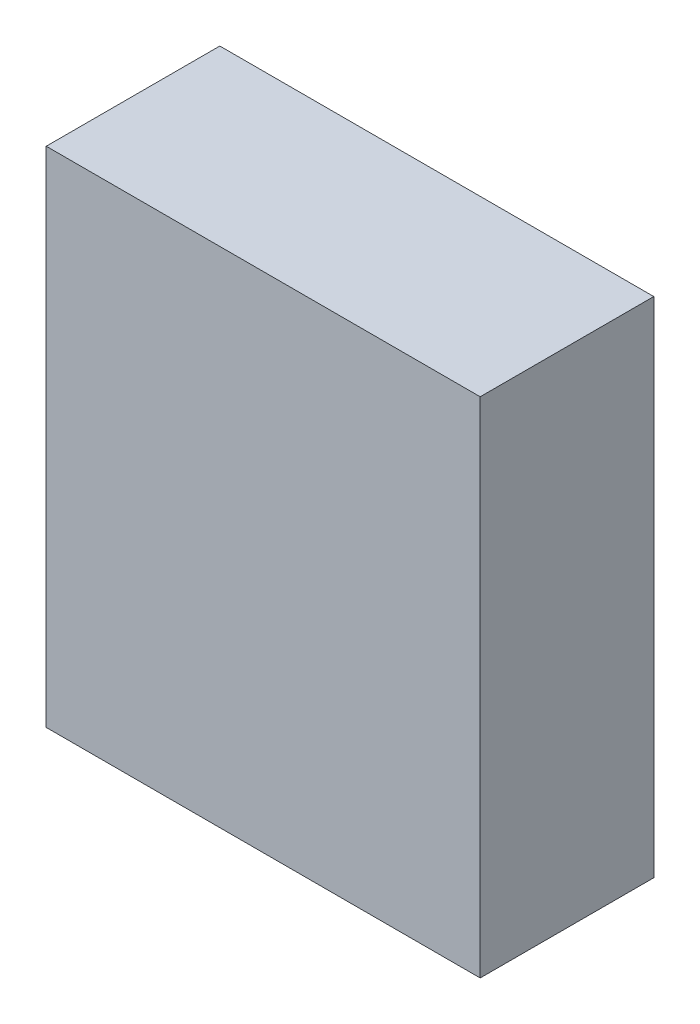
ISO-10303-21;
HEADER;
FILE_DESCRIPTION(('STEP AP214'),'2;1');
FILE_NAME('part.step','',(''),(''),'','','');
FILE_SCHEMA(('AUTOMOTIVE_DESIGN { 1 0 10303 214 1 1 1 1 }'));
ENDSEC;
DATA;
#1=APPLICATION_CONTEXT('core data for automotive mechanical design processes');
#2=APPLICATION_PROTOCOL_DEFINITION('international standard','automotive_design',2000,#1);
#3=PRODUCT_CONTEXT('',#1,'mechanical');
#4=PRODUCT('Part','Part','',(#3));
#5=PRODUCT_RELATED_PRODUCT_CATEGORY('part','',(#4));
#6=PRODUCT_DEFINITION_FORMATION('','',#4);
#7=PRODUCT_DEFINITION_CONTEXT('part definition',#1,'design');
#8=PRODUCT_DEFINITION('design','',#6,#7);
#9=PRODUCT_DEFINITION_SHAPE('','',#8);
#10=(LENGTH_UNIT() NAMED_UNIT(*) SI_UNIT(.MILLI.,.METRE.));
#11=(NAMED_UNIT(*) PLANE_ANGLE_UNIT() SI_UNIT($,.RADIAN.));
#12=(NAMED_UNIT(*) SI_UNIT($,.STERADIAN.) SOLID_ANGLE_UNIT());
#13=UNCERTAINTY_MEASURE_WITH_UNIT(LENGTH_MEASURE(1.E-05),#10,'distance_accuracy_value','');
#14=(GEOMETRIC_REPRESENTATION_CONTEXT(3) GLOBAL_UNCERTAINTY_ASSIGNED_CONTEXT((#13)) GLOBAL_UNIT_ASSIGNED_CONTEXT((#10,
#11,#12)) REPRESENTATION_CONTEXT('',''));
#15=CARTESIAN_POINT('',(0.,0.,0.));
#16=DIRECTION('',(0.,0.,1.));
#17=DIRECTION('',(1.,0.,0.));
#18=AXIS2_PLACEMENT_3D('',#15,#16,#17);
#19=CARTESIAN_POINT('',(0.,1.27000001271E-06,0.499999));
#20=DIRECTION('',(0.,0.,-1.));
#21=DIRECTION('',(0.,-1.,0.));
#22=AXIS2_PLACEMENT_3D('',#19,#20,#21);
#23=PLANE('',#22);
#24=DIRECTION('',(0.,1.,0.));
#25=VECTOR('',#24,1.);
#26=CARTESIAN_POINT('',(-0.62500002,-0.72499982,0.499999));
#27=LINE('',#26,#25);
#28=CARTESIAN_POINT('',(-0.62500002,-0.72499982,0.499999));
#29=VERTEX_POINT('',#28);
#30=CARTESIAN_POINT('',(-0.62500002,0.72500236,0.499999));
#31=VERTEX_POINT('',#30);
#32=EDGE_CURVE('E20',#29,#31,#27,.T.);
#33=ORIENTED_EDGE('',*,*,#32,.F.);
#34=DIRECTION('',(-1.,0.,0.));
#35=VECTOR('',#34,1.);
#36=CARTESIAN_POINT('',(0.62500002,-0.72499982,0.499999));
#37=LINE('',#36,#35);
#38=CARTESIAN_POINT('',(0.62500002,-0.72499982,0.499999));
#39=VERTEX_POINT('',#38);
#40=EDGE_CURVE('E67',#39,#29,#37,.T.);
#41=ORIENTED_EDGE('',*,*,#40,.F.);
#42=DIRECTION('',(0.,-1.,0.));
#43=VECTOR('',#42,1.);
#44=CARTESIAN_POINT('',(0.62500002,0.72500236,0.499999));
#45=LINE('',#44,#43);
#46=CARTESIAN_POINT('',(0.62500002,0.72500236,0.499999));
#47=VERTEX_POINT('',#46);
#48=EDGE_CURVE('E70',#47,#39,#45,.T.);
#49=ORIENTED_EDGE('',*,*,#48,.F.);
#50=DIRECTION('',(1.,0.,0.));
#51=VECTOR('',#50,1.);
#52=CARTESIAN_POINT('',(-0.62500002,0.72500236,0.499999));
#53=LINE('',#52,#51);
#54=EDGE_CURVE('E114',#31,#47,#53,.T.);
#55=ORIENTED_EDGE('',*,*,#54,.F.);
#56=EDGE_LOOP('',(#33,#41,#49,#55));
#57=FACE_BOUND('',#56,.T.);
#58=ADVANCED_FACE('F17',(#57),#23,.F.);
#59=CARTESIAN_POINT('',(0.,1.27000001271E-06,0.));
#60=DIRECTION('',(0.,0.,-1.));
#61=DIRECTION('',(0.,-1.,0.));
#62=AXIS2_PLACEMENT_3D('',#59,#60,#61);
#63=PLANE('',#62);
#64=DIRECTION('',(1.,0.,0.));
#65=VECTOR('',#64,1.);
#66=CARTESIAN_POINT('',(-0.62500002,0.72500236,0.));
#67=LINE('',#66,#65);
#68=CARTESIAN_POINT('',(-0.62500002,0.72500236,0.));
#69=VERTEX_POINT('',#68);
#70=CARTESIAN_POINT('',(0.62500002,0.72500236,0.));
#71=VERTEX_POINT('',#70);
#72=EDGE_CURVE('E91',#69,#71,#67,.T.);
#73=ORIENTED_EDGE('',*,*,#72,.T.);
#74=DIRECTION('',(0.,-1.,0.));
#75=VECTOR('',#74,1.);
#76=CARTESIAN_POINT('',(0.62500002,0.72500236,0.));
#77=LINE('',#76,#75);
#78=CARTESIAN_POINT('',(0.62500002,-0.72499982,0.));
#79=VERTEX_POINT('',#78);
#80=EDGE_CURVE('E76',#71,#79,#77,.T.);
#81=ORIENTED_EDGE('',*,*,#80,.T.);
#82=DIRECTION('',(-1.,0.,0.));
#83=VECTOR('',#82,1.);
#84=CARTESIAN_POINT('',(0.62500002,-0.72499982,0.));
#85=LINE('',#84,#83);
#86=CARTESIAN_POINT('',(-0.62500002,-0.72499982,0.));
#87=VERTEX_POINT('',#86);
#88=EDGE_CURVE('E81',#79,#87,#85,.T.);
#89=ORIENTED_EDGE('',*,*,#88,.T.);
#90=DIRECTION('',(0.,1.,0.));
#91=VECTOR('',#90,1.);
#92=CARTESIAN_POINT('',(-0.62500002,-0.72499982,0.));
#93=LINE('',#92,#91);
#94=EDGE_CURVE('E11',#87,#69,#93,.T.);
#95=ORIENTED_EDGE('',*,*,#94,.T.);
#96=EDGE_LOOP('',(#73,#81,#89,#95));
#97=FACE_BOUND('',#96,.T.);
#98=ADVANCED_FACE('F182',(#97),#63,.T.);
#99=CARTESIAN_POINT('',(-0.62500002,-0.72499982,0.));
#100=DIRECTION('',(-1.,0.,0.));
#101=DIRECTION('',(0.,0.,1.));
#102=AXIS2_PLACEMENT_3D('',#99,#100,#101);
#103=PLANE('',#102);
#104=DIRECTION('',(0.,0.,1.));
#105=VECTOR('',#104,1.);
#106=CARTESIAN_POINT('',(-0.62500002,-0.72499982,0.));
#107=LINE('',#106,#105);
#108=EDGE_CURVE('E75',#87,#29,#107,.T.);
#109=ORIENTED_EDGE('',*,*,#108,.T.);
#110=ORIENTED_EDGE('',*,*,#32,.T.);
#111=DIRECTION('',(0.,0.,1.));
#112=VECTOR('',#111,1.);
#113=CARTESIAN_POINT('',(-0.62500002,0.72500236,0.));
#114=LINE('',#113,#112);
#115=EDGE_CURVE('E113',#69,#31,#114,.T.);
#116=ORIENTED_EDGE('',*,*,#115,.F.);
#117=ORIENTED_EDGE('',*,*,#94,.F.);
#118=EDGE_LOOP('',(#109,#110,#116,#117));
#119=FACE_BOUND('',#118,.T.);
#120=ADVANCED_FACE('F111',(#119),#103,.T.);
#121=CARTESIAN_POINT('',(0.62500002,-0.72499982,0.));
#122=DIRECTION('',(0.,-1.,0.));
#123=DIRECTION('',(0.,0.,-1.));
#124=AXIS2_PLACEMENT_3D('',#121,#122,#123);
#125=PLANE('',#124);
#126=DIRECTION('',(0.,0.,1.));
#127=VECTOR('',#126,1.);
#128=CARTESIAN_POINT('',(0.62500002,-0.72499982,0.));
#129=LINE('',#128,#127);
#130=EDGE_CURVE('E79',#79,#39,#129,.T.);
#131=ORIENTED_EDGE('',*,*,#130,.T.);
#132=ORIENTED_EDGE('',*,*,#40,.T.);
#133=ORIENTED_EDGE('',*,*,#108,.F.);
#134=ORIENTED_EDGE('',*,*,#88,.F.);
#135=EDGE_LOOP('',(#131,#132,#133,#134));
#136=FACE_BOUND('',#135,.T.);
#137=ADVANCED_FACE('F80',(#136),#125,.T.);
#138=CARTESIAN_POINT('',(0.62500002,0.72500236,0.));
#139=DIRECTION('',(1.,0.,0.));
#140=DIRECTION('',(0.,1.,0.));
#141=AXIS2_PLACEMENT_3D('',#138,#139,#140);
#142=PLANE('',#141);
#143=DIRECTION('',(0.,0.,1.));
#144=VECTOR('',#143,1.);
#145=CARTESIAN_POINT('',(0.62500002,0.72500236,0.));
#146=LINE('',#145,#144);
#147=EDGE_CURVE('E88',#71,#47,#146,.T.);
#148=ORIENTED_EDGE('',*,*,#147,.T.);
#149=ORIENTED_EDGE('',*,*,#48,.T.);
#150=ORIENTED_EDGE('',*,*,#130,.F.);
#151=ORIENTED_EDGE('',*,*,#80,.F.);
#152=EDGE_LOOP('',(#148,#149,#150,#151));
#153=FACE_BOUND('',#152,.T.);
#154=ADVANCED_FACE('F86',(#153),#142,.T.);
#155=CARTESIAN_POINT('',(-0.62500002,0.72500236,0.));
#156=DIRECTION('',(0.,1.,0.));
#157=DIRECTION('',(1.,0.,0.));
#158=AXIS2_PLACEMENT_3D('',#155,#156,#157);
#159=PLANE('',#158);
#160=ORIENTED_EDGE('',*,*,#115,.T.);
#161=ORIENTED_EDGE('',*,*,#54,.T.);
#162=ORIENTED_EDGE('',*,*,#147,.F.);
#163=ORIENTED_EDGE('',*,*,#72,.F.);
#164=EDGE_LOOP('',(#160,#161,#162,#163));
#165=FACE_BOUND('',#164,.T.);
#166=ADVANCED_FACE('F119',(#165),#159,.T.);
#167=CLOSED_SHELL('',(#58,#98,#120,#137,#154,#166));
#168=MANIFOLD_SOLID_BREP('B1',#167);
#169=ADVANCED_BREP_SHAPE_REPRESENTATION('',(#18,#168),#14);
#170=SHAPE_DEFINITION_REPRESENTATION(#9,#169);
ENDSEC;
END-ISO-10303-21;
